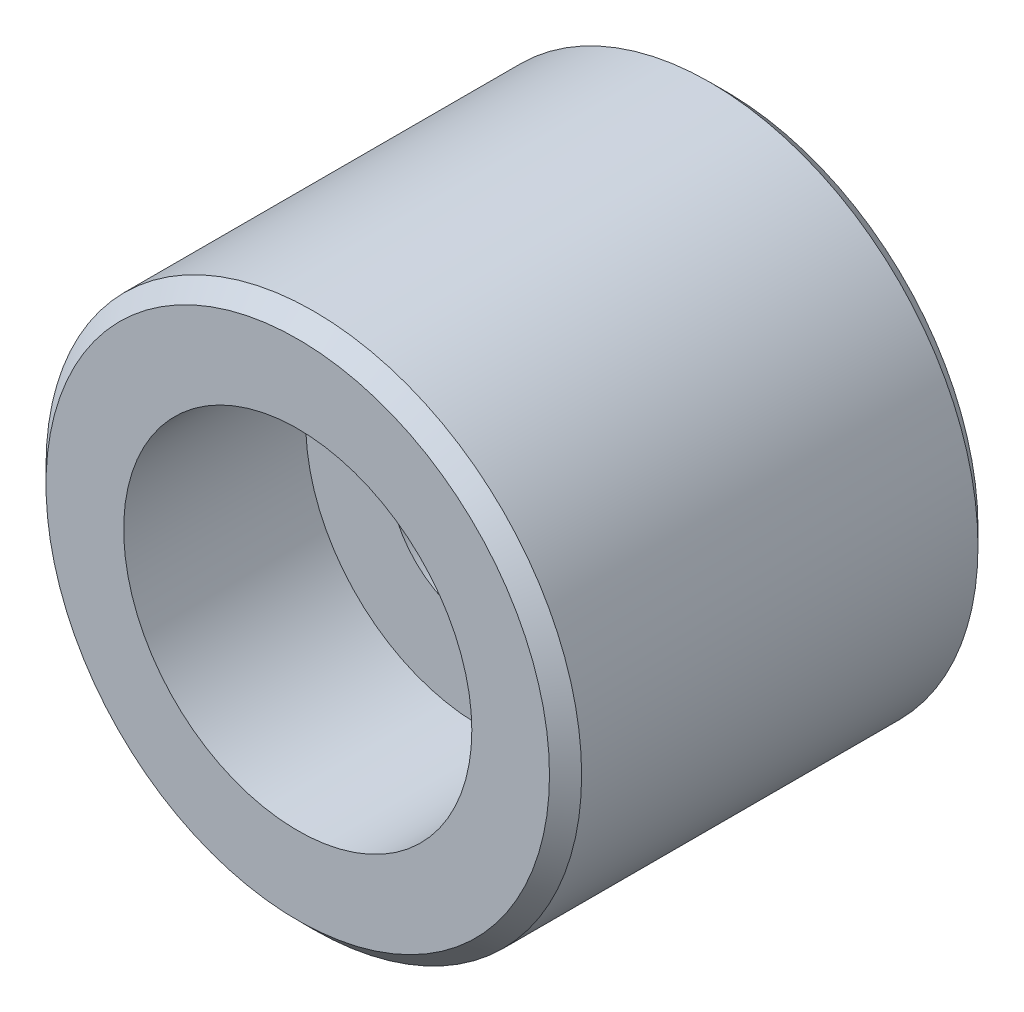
from build123d import *

# Parameters (mm, degrees)
SKIZZE1_R                                            = 5
AUFSATZ_LINEAR_AUSTRAGEN1_DEPTH                      = 8
STIRNSENKUNG_F_R_M3_ZYLINDERSCHRAUBE_MIT_D           = 3.4
STIRNSENKUNG_F_R_M3_ZYLINDERSCHRAUBE_MIT_CBORE_D     = 6.5
STIRNSENKUNG_F_R_M3_ZYLINDERSCHRAUBE_MIT_CBORE_DEPTH = 3.4
FASE1_SIZE                                           = 0.3


with BuildPart() as part:
    # Skizze1 → Aufsatz-Linear austragen1 (new body)
    with BuildSketch(Plane.XY):
        Circle(SKIZZE1_R)
    extrude(amount=AUFSATZ_LINEAR_AUSTRAGEN1_DEPTH)

    # Stirnsenkung f_r M3 Zylinderschraube mit (through all)
    with Locations(Plane.XY.offset(8)):
        with Locations((0, 0)):
            CounterBoreHole(STIRNSENKUNG_F_R_M3_ZYLINDERSCHRAUBE_MIT_D / 2, STIRNSENKUNG_F_R_M3_ZYLINDERSCHRAUBE_MIT_CBORE_D / 2, STIRNSENKUNG_F_R_M3_ZYLINDERSCHRAUBE_MIT_CBORE_DEPTH)

    # Fase1
    fase1_edges = [part.edges().sort_by_distance(p)[0] for p in [
        (-5, 0, 0),
        (-5, 0, 8),
        (1.7, 0, 0),
    ]]
    chamfer(fase1_edges, length=FASE1_SIZE)


solid = part.part
